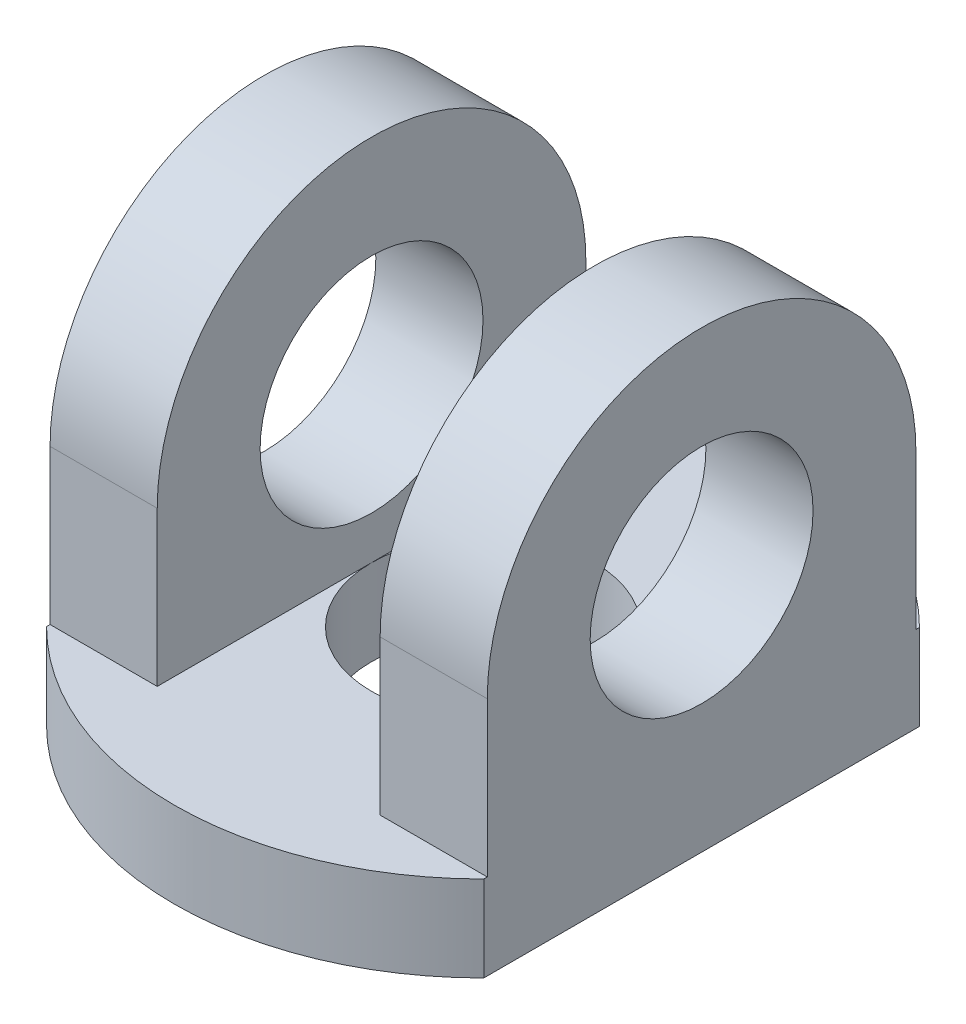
from build123d import *

# Parameters (mm, degrees)
SKETCH_1_R               = 72
EXTRUDE_1_DEPTH          = 20
EXTRUDE_2_DEPTH          = 51
EXTRUDE_2_DEPTH_BACK     = 51
CUT_EXTRUDE_1_DEPTH      = 147.982992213
CUT_EXTRUDE_1_DEPTH_BACK = 147.982992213
SKETCH_4_W               = 52
SKETCH_4_H               = 86
SKETCH_5_R               = 26
CUT_EXTRUDE_2_DEPTH      = 178.620381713
SKETCH_6_R               = 26
CUT_EXTRUDE_3_DEPTH      = 102
CUT_EXTRUDE_4_DEPTH      = 134.281656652
CUT_EXTRUDE_5_DEPTH      = 134.281656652


with BuildPart() as part:
    # Sketch 1 → Extrude 1 (new body)
    with BuildSketch(Plane(origin=(0, 0, 0), x_dir=(1, 0, 0), z_dir=(0, 1, 0))):
        with Locations(Location((0, 0, 0), (0, 0, 270))):
            Circle(SKETCH_1_R)
    extrude(amount=EXTRUDE_1_DEPTH)

    # Sketch 2 → Extrude 2 (add, two sides: drawn at the far end of the back side and taken through both)
    with BuildSketch(Plane(origin=(0, 0, 0), x_dir=(0, 0, -1), z_dir=(1, 0, 0)).offset(-EXTRUDE_2_DEPTH_BACK)):
        with BuildLine():
            Line((-50, 20), (50, 20))
            Line((50, 20), (50, 56))
            ThreePointArc((50, 56), (0, 106), (-50, 56))
            Line((-50, 56), (-50, 20))
        make_face()
    extrude(amount=EXTRUDE_2_DEPTH + EXTRUDE_2_DEPTH_BACK)

    # Sketch 4 → Cut-Extrude 1 (cut, two sides: drawn at the far end of the back side and taken through both)
    with BuildSketch(Plane.XY.offset(-CUT_EXTRUDE_1_DEPTH_BACK)):
        with Locations((0, 63)):
            Rectangle(SKETCH_4_W, SKETCH_4_H)
    extrude(amount=CUT_EXTRUDE_1_DEPTH + CUT_EXTRUDE_1_DEPTH_BACK, mode=Mode.SUBTRACT)

    # Sketch 5 → Cut-Extrude 2 (cut, through all)
    with BuildSketch(Plane.ZY.offset(51)):
        with Locations(Location((0, 56, 0), (0, 0, 90))):
            Circle(SKETCH_5_R)
    extrude(amount=-CUT_EXTRUDE_2_DEPTH, mode=Mode.SUBTRACT)

    # Sketch 6 → Cut-Extrude 3 (cut)
    with BuildSketch(Plane(origin=(0, 20, 0), x_dir=(1, 0, 0), z_dir=(0, 1, 0))):
        with Locations(Location((0, 0, 0), (0, 0, 270))):
            Circle(SKETCH_6_R)
    extrude(amount=-CUT_EXTRUDE_3_DEPTH, mode=Mode.SUBTRACT)

    # Sketch 7 → Cut-Extrude 4 (cut, through all)
    with BuildSketch(Plane(origin=(0, 20, 0), x_dir=(1, 0, 0), z_dir=(0, 1, 0))):
        Polygon((-51, 50), (-51, -59.534883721), (-94.88372093, -59.534883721), (-94.88372093, 61.129568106), (-51, 61.129568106), align=None)
    extrude(amount=-CUT_EXTRUDE_4_DEPTH, mode=Mode.SUBTRACT)

    # Sketch 8 → Cut-Extrude 5 (cut, through all)
    with BuildSketch(Plane(origin=(0, 20, 0), x_dir=(1, 0, 0), z_dir=(0, 1, 0))):
        Polygon((83.986710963, 50), (83.986710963, 86.418486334), (51, 86.418486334), (51, 50), (51, -53.42192691), (83.986710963, -53.42192691), align=None)
    extrude(amount=-CUT_EXTRUDE_5_DEPTH, mode=Mode.SUBTRACT)


solid = part.part
